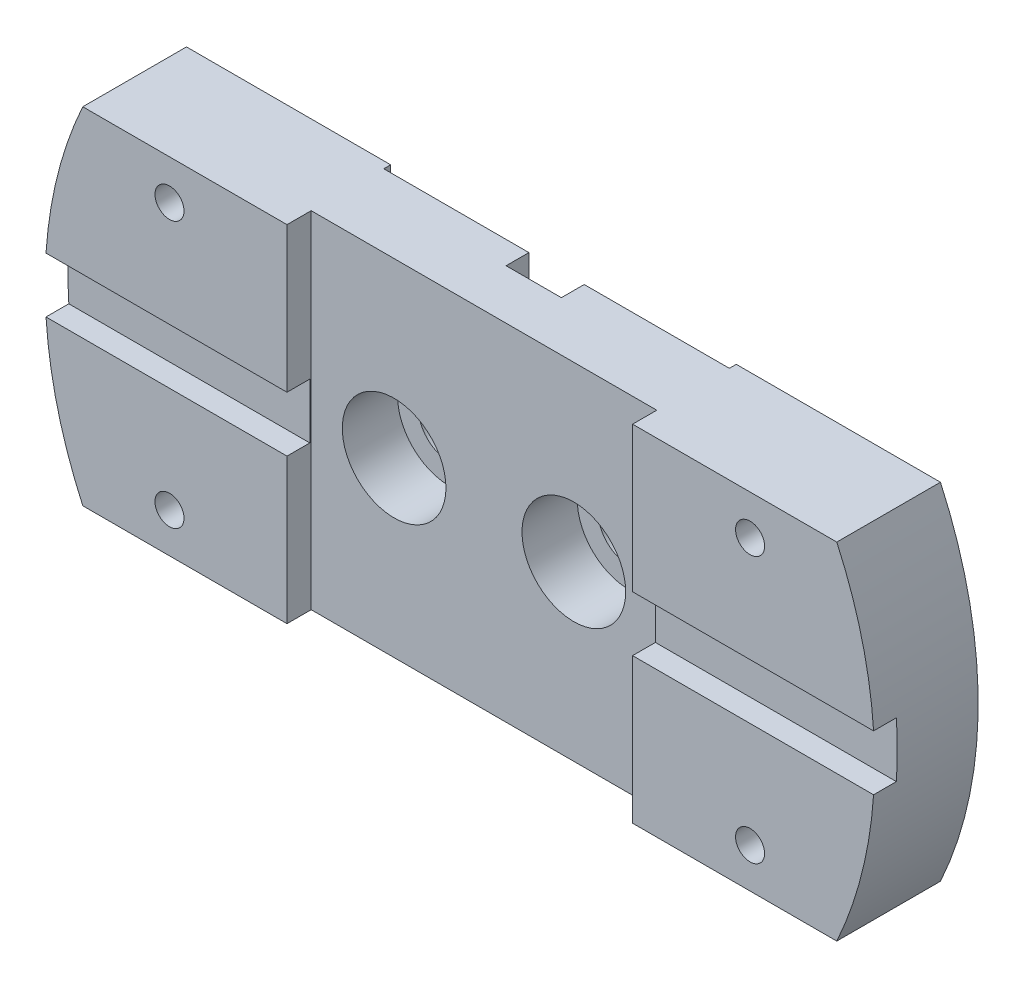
from build123d import *

# Parameters (mm, degrees)
EXTRUSION1_DEPTH                                = 15
ENL_V_MAT_EXTRU_1_DEPTH                         = 67.708320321
ENL_V_MAT_EXTRU_1_DEPTH_BACK                    = 67.708320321
ESQUISSE2_W                                     = 50
ESQUISSE2_H                                     = 10
ESQUISSE3_W                                     = 8
ESQUISSE3_H                                     = 60
ENL_V_MAT_EXTRU_2_DEPTH                         = 3.3
ESQUISSE4_W                                     = 50
ESQUISSE4_H                                     = 60
ENL_V_MAT_EXTRU_3_DEPTH                         = 3.5
ENL_V_MAT_EXTRU_4_DEPTH                         = 67.708320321
ENL_V_MAT_EXTRU_4_DEPTH_BACK                    = 67.708320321
ESQUISSE5_W                                     = 10
ESQUISSE5_H                                     = 8
CHAMBRAGE_POUR_VIS_T_TE_CYLINDRIQUE_D           = 9
CHAMBRAGE_POUR_VIS_T_TE_CYLINDRIQUE_DEPTH       = 20
CHAMBRAGE_POUR_VIS_T_TE_CYLINDRIQUE_CBORE_D     = 15
CHAMBRAGE_POUR_VIS_T_TE_CYLINDRIQUE_CBORE_DEPTH = 8
CHAMBRAGE_POUR_VIS_T_TE_CYLINDRIQUE_TIP         = 2.703872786
TROU_TARAUD_M5X0_81_D                           = 4.2


with BuildPart() as part:
    # Esquisse1 → Extrusion1 (new body)
    with BuildSketch(Plane.XY):
        with BuildLine():
            Line((-54.543560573, 25), (54.543560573, 25))
            ThreePointArc((54.543560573, 25), (60, 0), (54.543560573, -25))
            Line((54.543560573, -25), (-54.543560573, -25))
            ThreePointArc((-54.543560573, -25), (-60, 0), (-54.543560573, 25))
        make_face()
    extrude(amount=EXTRUSION1_DEPTH)

    # Esquisse2 → Enl_v. mat.-Extru.1 (cut, two sides: drawn at the far end of the back side and taken through both)
    with BuildSketch(Plane(origin=(0, 0, 0), x_dir=(1, 0, 0), z_dir=(0, 1, 0)).offset(-ENL_V_MAT_EXTRU_1_DEPTH_BACK)):
        with Locations((0, 4)):
            Rectangle(ESQUISSE2_W, ESQUISSE2_H)
    extrude(amount=ENL_V_MAT_EXTRU_1_DEPTH + ENL_V_MAT_EXTRU_1_DEPTH_BACK, mode=Mode.SUBTRACT)

    # Esquisse3 → Enl_v. mat.-Extru.2 (cut)
    with BuildSketch(Plane(origin=(0, 0, 1), x_dir=(-1, 0, 0), z_dir=(0, 0, -1))):
        Rectangle(ESQUISSE3_W, ESQUISSE3_H)
    extrude(amount=-ENL_V_MAT_EXTRU_2_DEPTH, mode=Mode.SUBTRACT)

    # Esquisse4 → Enl_v. mat.-Extru.3 (cut)
    with BuildSketch(Plane.XY.offset(15)):
        Rectangle(ESQUISSE4_W, ESQUISSE4_H)
    extrude(amount=-ENL_V_MAT_EXTRU_3_DEPTH, mode=Mode.SUBTRACT)

    # Esquisse5 → Enl_v. mat.-Extru.4 (cut, two sides: drawn at the far end of the back side and taken through both)
    with BuildSketch(Plane(origin=(0, 0, 0), x_dir=(0, 0, -1), z_dir=(1, 0, 0)).offset(-ENL_V_MAT_EXTRU_4_DEPTH_BACK)):
        with Locations((-16.7, 0)):
            Rectangle(ESQUISSE5_W, ESQUISSE5_H)
    extrude(amount=ENL_V_MAT_EXTRU_4_DEPTH + ENL_V_MAT_EXTRU_4_DEPTH_BACK, mode=Mode.SUBTRACT)

    # Chambrage pour vis _ t_te cylindrique
    with Locations(Plane.XY.offset(11.5)):
        with Locations((13, 0), (-13, 0)):
            CounterBoreHole(CHAMBRAGE_POUR_VIS_T_TE_CYLINDRIQUE_D / 2, CHAMBRAGE_POUR_VIS_T_TE_CYLINDRIQUE_CBORE_D / 2, CHAMBRAGE_POUR_VIS_T_TE_CYLINDRIQUE_CBORE_DEPTH, depth=CHAMBRAGE_POUR_VIS_T_TE_CYLINDRIQUE_DEPTH)
            with Locations((0, 0, -(CHAMBRAGE_POUR_VIS_T_TE_CYLINDRIQUE_DEPTH + CHAMBRAGE_POUR_VIS_T_TE_CYLINDRIQUE_TIP / 2))):  # 118° drill point
                Cone(0, CHAMBRAGE_POUR_VIS_T_TE_CYLINDRIQUE_D / 2, CHAMBRAGE_POUR_VIS_T_TE_CYLINDRIQUE_TIP, mode=Mode.SUBTRACT)

    # Trou taraud_ M5x0.81 (through all)
    with Locations(Plane.XY.offset(15)):
        with Locations((-42, -19.25), (42, -19.25), (-42, 19.25), (42, 19.25)):
            Hole(TROU_TARAUD_M5X0_81_D / 2)


solid = part.part
